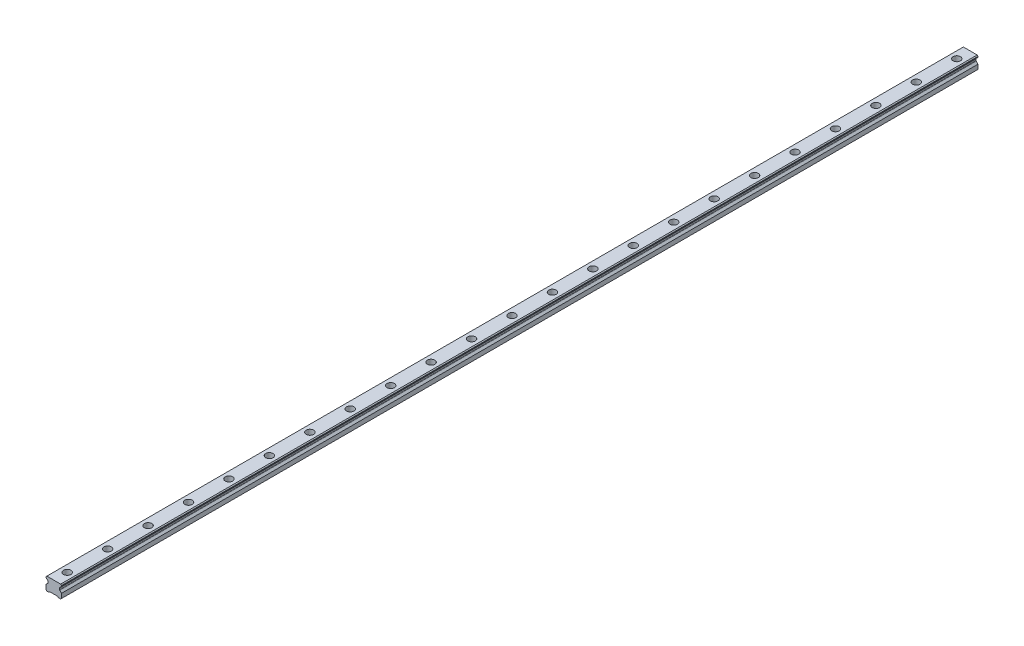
from build123d import *

# Parameters (mm, degrees)
SKETCH1_W           = 23
SKETCH1_H           = 19.2
BOSS_EXTRUDE1_DEPTH = 680
CUT_EXTRUDE1_DEPTH  = 1361.18413827
CHAMFER1_SIZE       = 1.25
FILLET1_R           = 1.25
CUT_EXTRUDE2_DEPTH  = 1361.18413827
SKETCH4_R           = 5.5
SKETCH4_R_2         = 3.5
CUT_EXTRUDE3_DEPTH  = 9
SKETCH4_2_R         = 3.5
CUT_EXTRUDE4_DEPTH  = 681.368201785
LPATTERN1_COUNT     = 23
LPATTERN1_PITCH     = 60


with BuildPart() as part:
    # Sketch1 → Boss-Extrude1 (new, symmetric)
    with BuildSketch(Plane.XY):
        with Locations((0, 9.6)):
            Rectangle(SKETCH1_W, SKETCH1_H)
    extrude(amount=BOSS_EXTRUDE1_DEPTH, both=True)

    # Sketch2 → Cut-Extrude1 (cut, through all)
    with BuildSketch(Plane.XY.offset(680)):
        Polygon((-11.5, 16.7), (-11.5, 7.95), (-8.583333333, 10.866666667), (-8.583333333, 13.783333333), align=None)
        Polygon((8.583333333, 13.783333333), (11.5, 16.7), (11.5, 7.95), (8.583333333, 10.866666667), align=None)
    extrude(amount=-CUT_EXTRUDE1_DEPTH, mode=Mode.SUBTRACT)

    # Chamfer1
    chamfer1_edges = [part.edges().sort_by_distance(p)[0] for p in [
        (-11.5, 19.2, 0),
        (11.5, 19.2, 0),
        (11.5, 0, 0),
        (-11.5, 0, 0),
    ]]
    chamfer(chamfer1_edges, length=CHAMFER1_SIZE)

    # Fillet1
    fillet1_edges = [part.edges().sort_by_distance(p)[0] for p in [
        (-8.583333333, 13.783333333, 0),
        (-8.583333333, 10.866666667, 0),
        (8.583333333, 10.866666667, 0),
        (8.583333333, 13.783333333, 0),
    ]]
    fillet(fillet1_edges, radius=FILLET1_R)

    # Sketch3 → Cut-Extrude2 (cut, through all)
    with BuildSketch(Plane.XY.offset(680)):
        Polygon((-7, 0), (-5.75, 1.25), (5.75, 1.25), (7, 0), align=None)
    extrude(amount=-CUT_EXTRUDE2_DEPTH, mode=Mode.SUBTRACT)

    # Sketch4 → Cut-Extrude3 (cut)
    with BuildSketch(Plane(origin=(0, 19.2, 0), x_dir=(1, 0, 0), z_dir=(0, 1, 0))):
        with Locations(Location((0, -660, 0), (0, 0, 270))):
            Circle(SKETCH4_R)
        with Locations(Location((0, -660, 0), (0, 0, 270))):
            Circle(SKETCH4_R_2, mode=Mode.SUBTRACT)
    cut_extrude3 = extrude(amount=-CUT_EXTRUDE3_DEPTH, mode=Mode.SUBTRACT)

    # Sketch4_2 → Cut-Extrude4 (cut, through all)
    with BuildSketch(Plane(origin=(0, 19.2, 0), x_dir=(1, 0, 0), z_dir=(0, 1, 0))):
        with Locations(Location((0, -660, 0), (0, 0, 270))):
            Circle(SKETCH4_2_R)
    cut_extrude4 = extrude(amount=-CUT_EXTRUDE4_DEPTH, mode=Mode.SUBTRACT)

    # LPattern1: Cut-Extrude3, Cut-Extrude4 ×23
    with Locations(*[(0, 0, -i * LPATTERN1_PITCH) for i in range(1, LPATTERN1_COUNT)]):
        add(cut_extrude3, mode=Mode.SUBTRACT)
        add(cut_extrude4, mode=Mode.SUBTRACT)


solid = part.part
